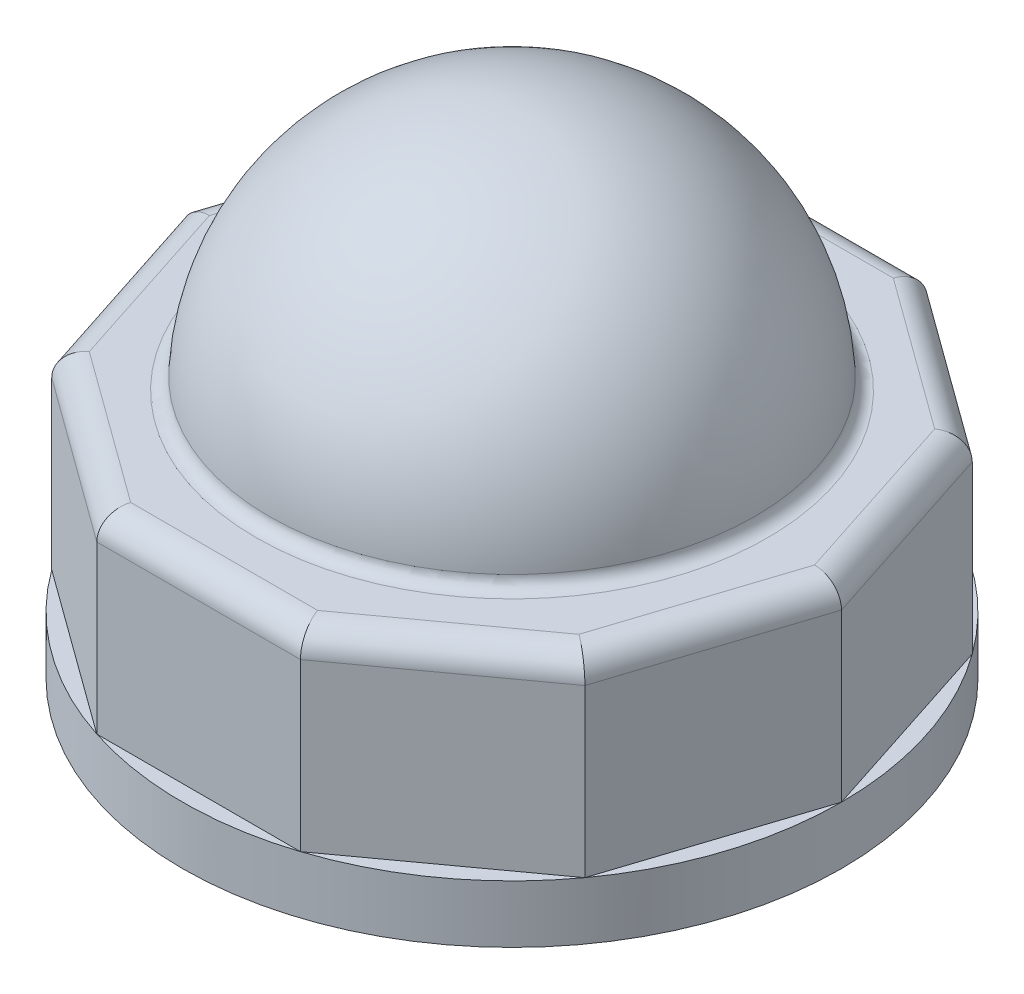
ISO-10303-21;
HEADER;
FILE_DESCRIPTION(('STEP AP214'),'2;1');
FILE_NAME('part.step','',(''),(''),'','','');
FILE_SCHEMA(('AUTOMOTIVE_DESIGN { 1 0 10303 214 1 1 1 1 }'));
ENDSEC;
DATA;
#1=APPLICATION_CONTEXT('core data for automotive mechanical design processes');
#2=APPLICATION_PROTOCOL_DEFINITION('international standard','automotive_design',2000,#1);
#3=PRODUCT_CONTEXT('',#1,'mechanical');
#4=PRODUCT('Part','Part','',(#3));
#5=PRODUCT_RELATED_PRODUCT_CATEGORY('part','',(#4));
#6=PRODUCT_DEFINITION_FORMATION('','',#4);
#7=PRODUCT_DEFINITION_CONTEXT('part definition',#1,'design');
#8=PRODUCT_DEFINITION('design','',#6,#7);
#9=PRODUCT_DEFINITION_SHAPE('','',#8);
#10=(LENGTH_UNIT() NAMED_UNIT(*) SI_UNIT(.MILLI.,.METRE.));
#11=(NAMED_UNIT(*) PLANE_ANGLE_UNIT() SI_UNIT($,.RADIAN.));
#12=(NAMED_UNIT(*) SI_UNIT($,.STERADIAN.) SOLID_ANGLE_UNIT());
#13=UNCERTAINTY_MEASURE_WITH_UNIT(LENGTH_MEASURE(1.E-05),#10,'distance_accuracy_value','');
#14=(GEOMETRIC_REPRESENTATION_CONTEXT(3) GLOBAL_UNCERTAINTY_ASSIGNED_CONTEXT((#13)) GLOBAL_UNIT_ASSIGNED_CONTEXT((#10,
#11,#12)) REPRESENTATION_CONTEXT('',''));
#15=CARTESIAN_POINT('',(0.,0.,0.));
#16=DIRECTION('',(0.,0.,1.));
#17=DIRECTION('',(1.,0.,0.));
#18=AXIS2_PLACEMENT_3D('',#15,#16,#17);
#19=CARTESIAN_POINT('',(0.,0.,0.));
#20=DIRECTION('',(0.,-1.,0.));
#21=DIRECTION('',(0.,0.,-1.));
#22=AXIS2_PLACEMENT_3D('',#19,#20,#21);
#23=CYLINDRICAL_SURFACE('',#22,25.75);
#24=CARTESIAN_POINT('',(0.,0.5,0.));
#25=DIRECTION('',(0.,-1.,0.));
#26=DIRECTION('',(0.,0.,-1.));
#27=AXIS2_PLACEMENT_3D('',#24,#25,#26);
#28=CIRCLE('',#27,25.75);
#29=CARTESIAN_POINT('',(0.,0.5,-25.75));
#30=VERTEX_POINT('',#29);
#31=EDGE_CURVE('E329',#30,#30,#28,.T.);
#32=ORIENTED_EDGE('',*,*,#31,.F.);
#33=EDGE_LOOP('',(#32));
#34=FACE_BOUND('',#33,.T.);
#35=CARTESIAN_POINT('',(0.,5.,0.));
#36=DIRECTION('',(0.,1.,0.));
#37=DIRECTION('',(0.,0.,1.));
#38=AXIS2_PLACEMENT_3D('',#35,#36,#37);
#39=CIRCLE('',#38,25.75);
#40=CARTESIAN_POINT('',(-20.8321876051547,5.,-15.1354702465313));
#41=VERTEX_POINT('',#40);
#42=CARTESIAN_POINT('',(-7.95718760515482,5.,-24.4897052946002));
#43=VERTEX_POINT('',#42);
#44=EDGE_CURVE('E150',#41,#43,#39,.F.);
#45=ORIENTED_EDGE('',*,*,#44,.T.);
#46=CARTESIAN_POINT('',(7.95718760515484,5.,-24.4897052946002));
#47=VERTEX_POINT('',#46);
#48=EDGE_CURVE('E157',#43,#47,#39,.F.);
#49=ORIENTED_EDGE('',*,*,#48,.T.);
#50=CARTESIAN_POINT('',(20.8321876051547,5.,-15.1354702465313));
#51=VERTEX_POINT('',#50);
#52=EDGE_CURVE('E175',#47,#51,#39,.F.);
#53=ORIENTED_EDGE('',*,*,#52,.T.);
#54=CARTESIAN_POINT('',(25.7499999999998,5.,-1.96032508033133E-13));
#55=VERTEX_POINT('',#54);
#56=EDGE_CURVE('E179',#51,#55,#39,.F.);
#57=ORIENTED_EDGE('',*,*,#56,.T.);
#58=CARTESIAN_POINT('',(20.8321876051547,5.,15.1354702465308));
#59=VERTEX_POINT('',#58);
#60=EDGE_CURVE('E790',#55,#59,#39,.F.);
#61=ORIENTED_EDGE('',*,*,#60,.T.);
#62=CARTESIAN_POINT('',(7.95718760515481,5.,24.4897052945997));
#63=VERTEX_POINT('',#62);
#64=EDGE_CURVE('E788',#59,#63,#39,.F.);
#65=ORIENTED_EDGE('',*,*,#64,.T.);
#66=CARTESIAN_POINT('',(-7.95718760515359,5.,24.4897052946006));
#67=VERTEX_POINT('',#66);
#68=EDGE_CURVE('E783',#63,#67,#39,.F.);
#69=ORIENTED_EDGE('',*,*,#68,.T.);
#70=CARTESIAN_POINT('',(-20.8321876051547,5.,15.1354702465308));
#71=VERTEX_POINT('',#70);
#72=EDGE_CURVE('E174',#67,#71,#39,.F.);
#73=ORIENTED_EDGE('',*,*,#72,.T.);
#74=CARTESIAN_POINT('',(-25.7499999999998,5.,-2.65074807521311E-13));
#75=VERTEX_POINT('',#74);
#76=EDGE_CURVE('E173',#71,#75,#39,.F.);
#77=ORIENTED_EDGE('',*,*,#76,.T.);
#78=EDGE_CURVE('E158',#75,#41,#39,.F.);
#79=ORIENTED_EDGE('',*,*,#78,.T.);
#80=EDGE_LOOP('',(#45,#49,#53,#57,#61,#65,#69,#73,#77,#79));
#81=FACE_BOUND('',#80,.T.);
#82=ADVANCED_FACE('F34',(#34,#81),#23,.T.);
#83=CARTESIAN_POINT('',(18.,17.,0.));
#84=DIRECTION('',(0.,-1.,0.));
#85=DIRECTION('',(0.,0.,-1.));
#86=AXIS2_PLACEMENT_3D('',#83,#84,#85);
#87=PLANE('',#86);
#88=CARTESIAN_POINT('',(0.,17.,0.));
#89=DIRECTION('',(0.,-1.,0.));
#90=DIRECTION('',(0.,0.,-1.));
#91=AXIS2_PLACEMENT_3D('',#88,#89,#90);
#92=CIRCLE('',#91,18.);
#93=CARTESIAN_POINT('',(0.,17.,-18.));
#94=VERTEX_POINT('',#93);
#95=EDGE_CURVE('E144',#94,#94,#92,.T.);
#96=ORIENTED_EDGE('',*,*,#95,.T.);
#97=EDGE_LOOP('',(#96));
#98=FACE_BOUND('',#97,.T.);
#99=CARTESIAN_POINT('',(0.,17.,0.));
#100=DIRECTION('',(0.,-1.,0.));
#101=DIRECTION('',(0.,0.,-1.));
#102=AXIS2_PLACEMENT_3D('',#99,#100,#101);
#103=CIRCLE('',#102,16.);
#104=CARTESIAN_POINT('',(0.,17.,-16.));
#105=VERTEX_POINT('',#104);
#106=EDGE_CURVE('E180',#105,#105,#103,.T.);
#107=ORIENTED_EDGE('',*,*,#106,.F.);
#108=EDGE_LOOP('',(#107));
#109=FACE_BOUND('',#108,.T.);
#110=ADVANCED_FACE('F36',(#98,#109),#87,.T.);
#111=CARTESIAN_POINT('',(0.,0.,0.));
#112=DIRECTION('',(0.,-1.,0.));
#113=DIRECTION('',(0.,0.,-1.));
#114=AXIS2_PLACEMENT_3D('',#111,#112,#113);
#115=CYLINDRICAL_SURFACE('',#114,16.);
#116=ORIENTED_EDGE('',*,*,#106,.T.);
#117=EDGE_LOOP('',(#116));
#118=FACE_BOUND('',#117,.T.);
#119=CARTESIAN_POINT('',(0.,20.,0.));
#120=DIRECTION('',(0.,-1.,0.));
#121=DIRECTION('',(0.,0.,-1.));
#122=AXIS2_PLACEMENT_3D('',#119,#120,#121);
#123=CIRCLE('',#122,16.);
#124=CARTESIAN_POINT('',(0.,20.,-16.));
#125=VERTEX_POINT('',#124);
#126=EDGE_CURVE('E331',#125,#125,#123,.T.);
#127=ORIENTED_EDGE('',*,*,#126,.F.);
#128=EDGE_LOOP('',(#127));
#129=FACE_BOUND('',#128,.T.);
#130=ADVANCED_FACE('F338',(#118,#129),#115,.F.);
#131=CARTESIAN_POINT('',(0.,20.,0.));
#132=DIRECTION('',(0.,-1.,0.));
#133=DIRECTION('',(-1.,0.,0.));
#134=AXIS2_PLACEMENT_3D('',#131,#132,#133);
#135=SPHERICAL_SURFACE('',#134,16.);
#136=ORIENTED_EDGE('',*,*,#126,.T.);
#137=EDGE_LOOP('',(#136));
#138=FACE_BOUND('',#137,.T.);
#139=ADVANCED_FACE('F347',(#138),#135,.F.);
#140=CARTESIAN_POINT('',(25.75,0.5,0.));
#141=DIRECTION('',(0.,-1.,0.));
#142=DIRECTION('',(0.,0.,-1.));
#143=AXIS2_PLACEMENT_3D('',#140,#141,#142);
#144=PLANE('',#143);
#145=ORIENTED_EDGE('',*,*,#31,.T.);
#146=EDGE_LOOP('',(#145));
#147=FACE_BOUND('',#146,.T.);
#148=CARTESIAN_POINT('',(0.,0.5,0.));
#149=DIRECTION('',(0.,-1.,0.));
#150=DIRECTION('',(0.,0.,-1.));
#151=AXIS2_PLACEMENT_3D('',#148,#149,#150);
#152=CIRCLE('',#151,24.);
#153=CARTESIAN_POINT('',(0.,0.5,-24.));
#154=VERTEX_POINT('',#153);
#155=EDGE_CURVE('E326',#154,#154,#152,.T.);
#156=ORIENTED_EDGE('',*,*,#155,.F.);
#157=EDGE_LOOP('',(#156));
#158=FACE_BOUND('',#157,.T.);
#159=ADVANCED_FACE('F397',(#147,#158),#144,.T.);
#160=CARTESIAN_POINT('',(0.,0.,0.));
#161=DIRECTION('',(0.,-1.,0.));
#162=DIRECTION('',(0.,0.,-1.));
#163=AXIS2_PLACEMENT_3D('',#160,#161,#162);
#164=CYLINDRICAL_SURFACE('',#163,24.);
#165=ORIENTED_EDGE('',*,*,#155,.T.);
#166=EDGE_LOOP('',(#165));
#167=FACE_BOUND('',#166,.T.);
#168=CARTESIAN_POINT('',(0.,0.,0.));
#169=DIRECTION('',(0.,-1.,0.));
#170=DIRECTION('',(0.,0.,-1.));
#171=AXIS2_PLACEMENT_3D('',#168,#169,#170);
#172=CIRCLE('',#171,24.);
#173=CARTESIAN_POINT('',(0.,0.,-24.));
#174=VERTEX_POINT('',#173);
#175=EDGE_CURVE('E323',#174,#174,#172,.T.);
#176=ORIENTED_EDGE('',*,*,#175,.F.);
#177=EDGE_LOOP('',(#176));
#178=FACE_BOUND('',#177,.T.);
#179=ADVANCED_FACE('F393',(#167,#178),#164,.T.);
#180=CARTESIAN_POINT('',(24.,0.,0.));
#181=DIRECTION('',(0.,-1.,0.));
#182=DIRECTION('',(0.,0.,-1.));
#183=AXIS2_PLACEMENT_3D('',#180,#181,#182);
#184=PLANE('',#183);
#185=ORIENTED_EDGE('',*,*,#175,.T.);
#186=EDGE_LOOP('',(#185));
#187=FACE_BOUND('',#186,.T.);
#188=CARTESIAN_POINT('',(0.,0.,0.));
#189=DIRECTION('',(0.,-1.,0.));
#190=DIRECTION('',(0.,0.,-1.));
#191=AXIS2_PLACEMENT_3D('',#188,#189,#190);
#192=CIRCLE('',#191,23.5);
#193=CARTESIAN_POINT('',(0.,0.,-23.5));
#194=VERTEX_POINT('',#193);
#195=EDGE_CURVE('E320',#194,#194,#192,.T.);
#196=ORIENTED_EDGE('',*,*,#195,.F.);
#197=EDGE_LOOP('',(#196));
#198=FACE_BOUND('',#197,.T.);
#199=ADVANCED_FACE('F389',(#187,#198),#184,.T.);
#200=CARTESIAN_POINT('',(0.,0.,0.));
#201=DIRECTION('',(0.,-1.,0.));
#202=DIRECTION('',(0.,0.,-1.));
#203=AXIS2_PLACEMENT_3D('',#200,#201,#202);
#204=CYLINDRICAL_SURFACE('',#203,23.5);
#205=ORIENTED_EDGE('',*,*,#195,.T.);
#206=EDGE_LOOP('',(#205));
#207=FACE_BOUND('',#206,.T.);
#208=CARTESIAN_POINT('',(0.,1.,0.));
#209=DIRECTION('',(0.,-1.,0.));
#210=DIRECTION('',(0.,0.,-1.));
#211=AXIS2_PLACEMENT_3D('',#208,#209,#210);
#212=CIRCLE('',#211,23.5);
#213=CARTESIAN_POINT('',(0.,1.,-23.5));
#214=VERTEX_POINT('',#213);
#215=EDGE_CURVE('E317',#214,#214,#212,.T.);
#216=ORIENTED_EDGE('',*,*,#215,.F.);
#217=EDGE_LOOP('',(#216));
#218=FACE_BOUND('',#217,.T.);
#219=ADVANCED_FACE('F385',(#207,#218),#204,.F.);
#220=CARTESIAN_POINT('',(23.5,1.,0.));
#221=DIRECTION('',(0.,-1.,0.));
#222=DIRECTION('',(0.,0.,-1.));
#223=AXIS2_PLACEMENT_3D('',#220,#221,#222);
#224=PLANE('',#223);
#225=ORIENTED_EDGE('',*,*,#215,.T.);
#226=EDGE_LOOP('',(#225));
#227=FACE_BOUND('',#226,.T.);
#228=CARTESIAN_POINT('',(0.,1.,0.));
#229=DIRECTION('',(0.,-1.,0.));
#230=DIRECTION('',(0.,0.,-1.));
#231=AXIS2_PLACEMENT_3D('',#228,#229,#230);
#232=CIRCLE('',#231,23.);
#233=CARTESIAN_POINT('',(0.,1.,-23.));
#234=VERTEX_POINT('',#233);
#235=EDGE_CURVE('E314',#234,#234,#232,.T.);
#236=ORIENTED_EDGE('',*,*,#235,.F.);
#237=EDGE_LOOP('',(#236));
#238=FACE_BOUND('',#237,.T.);
#239=ADVANCED_FACE('F381',(#227,#238),#224,.T.);
#240=CARTESIAN_POINT('',(0.,0.,0.));
#241=DIRECTION('',(0.,-1.,0.));
#242=DIRECTION('',(0.,0.,-1.));
#243=AXIS2_PLACEMENT_3D('',#240,#241,#242);
#244=CYLINDRICAL_SURFACE('',#243,23.);
#245=ORIENTED_EDGE('',*,*,#235,.T.);
#246=EDGE_LOOP('',(#245));
#247=FACE_BOUND('',#246,.T.);
#248=CARTESIAN_POINT('',(0.,3.,0.));
#249=DIRECTION('',(0.,-1.,0.));
#250=DIRECTION('',(0.,0.,-1.));
#251=AXIS2_PLACEMENT_3D('',#248,#249,#250);
#252=CIRCLE('',#251,23.);
#253=CARTESIAN_POINT('',(0.,3.,-23.));
#254=VERTEX_POINT('',#253);
#255=EDGE_CURVE('E311',#254,#254,#252,.T.);
#256=ORIENTED_EDGE('',*,*,#255,.F.);
#257=EDGE_LOOP('',(#256));
#258=FACE_BOUND('',#257,.T.);
#259=ADVANCED_FACE('F377',(#247,#258),#244,.F.);
#260=CARTESIAN_POINT('',(23.,3.,0.));
#261=DIRECTION('',(0.,-1.,0.));
#262=DIRECTION('',(0.,0.,-1.));
#263=AXIS2_PLACEMENT_3D('',#260,#261,#262);
#264=PLANE('',#263);
#265=ORIENTED_EDGE('',*,*,#255,.T.);
#266=EDGE_LOOP('',(#265));
#267=FACE_BOUND('',#266,.T.);
#268=CARTESIAN_POINT('',(0.,3.,0.));
#269=DIRECTION('',(0.,-1.,0.));
#270=DIRECTION('',(0.,0.,-1.));
#271=AXIS2_PLACEMENT_3D('',#268,#269,#270);
#272=CIRCLE('',#271,21.);
#273=CARTESIAN_POINT('',(0.,3.,-21.));
#274=VERTEX_POINT('',#273);
#275=EDGE_CURVE('E308',#274,#274,#272,.T.);
#276=ORIENTED_EDGE('',*,*,#275,.F.);
#277=EDGE_LOOP('',(#276));
#278=FACE_BOUND('',#277,.T.);
#279=ADVANCED_FACE('F373',(#267,#278),#264,.T.);
#280=CARTESIAN_POINT('',(0.,0.,0.));
#281=DIRECTION('',(0.,-1.,0.));
#282=DIRECTION('',(0.,0.,-1.));
#283=AXIS2_PLACEMENT_3D('',#280,#281,#282);
#284=CYLINDRICAL_SURFACE('',#283,21.);
#285=ORIENTED_EDGE('',*,*,#275,.T.);
#286=EDGE_LOOP('',(#285));
#287=FACE_BOUND('',#286,.T.);
#288=CARTESIAN_POINT('',(0.,16.,0.));
#289=DIRECTION('',(0.,-1.,0.));
#290=DIRECTION('',(0.,0.,-1.));
#291=AXIS2_PLACEMENT_3D('',#288,#289,#290);
#292=CIRCLE('',#291,21.);
#293=CARTESIAN_POINT('',(0.,16.,-21.));
#294=VERTEX_POINT('',#293);
#295=EDGE_CURVE('E305',#294,#294,#292,.T.);
#296=ORIENTED_EDGE('',*,*,#295,.F.);
#297=EDGE_LOOP('',(#296));
#298=FACE_BOUND('',#297,.T.);
#299=ADVANCED_FACE('F366',(#287,#298),#284,.F.);
#300=CARTESIAN_POINT('',(21.,16.,0.));
#301=DIRECTION('',(0.,-1.,0.));
#302=DIRECTION('',(0.,0.,-1.));
#303=AXIS2_PLACEMENT_3D('',#300,#301,#302);
#304=PLANE('',#303);
#305=ORIENTED_EDGE('',*,*,#295,.T.);
#306=EDGE_LOOP('',(#305));
#307=FACE_BOUND('',#306,.T.);
#308=CARTESIAN_POINT('',(0.,16.,0.));
#309=DIRECTION('',(0.,-1.,0.));
#310=DIRECTION('',(0.,0.,-1.));
#311=AXIS2_PLACEMENT_3D('',#308,#309,#310);
#312=CIRCLE('',#311,18.);
#313=CARTESIAN_POINT('',(0.,16.,-18.));
#314=VERTEX_POINT('',#313);
#315=EDGE_CURVE('E302',#314,#314,#312,.T.);
#316=ORIENTED_EDGE('',*,*,#315,.F.);
#317=EDGE_LOOP('',(#316));
#318=FACE_BOUND('',#317,.T.);
#319=ADVANCED_FACE('F355',(#307,#318),#304,.T.);
#320=CARTESIAN_POINT('',(0.,0.,0.));
#321=DIRECTION('',(0.,-1.,0.));
#322=DIRECTION('',(0.,0.,-1.));
#323=AXIS2_PLACEMENT_3D('',#320,#321,#322);
#324=CYLINDRICAL_SURFACE('',#323,18.);
#325=ORIENTED_EDGE('',*,*,#315,.T.);
#326=EDGE_LOOP('',(#325));
#327=FACE_BOUND('',#326,.T.);
#328=ORIENTED_EDGE('',*,*,#95,.F.);
#329=EDGE_LOOP('',(#328));
#330=FACE_BOUND('',#329,.T.);
#331=ADVANCED_FACE('F352',(#327,#330),#324,.F.);
#332=CARTESIAN_POINT('',(0.,5.,0.));
#333=DIRECTION('',(0.,1.,0.));
#334=DIRECTION('',(0.,0.,1.));
#335=AXIS2_PLACEMENT_3D('',#332,#333,#334);
#336=PLANE('',#335);
#337=DIRECTION('',(0.809016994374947,0.,0.587785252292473));
#338=VECTOR('',#337,1.);
#339=CARTESIAN_POINT('',(-7.95718760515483,5.,24.4897052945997));
#340=LINE('',#339,#338);
#341=EDGE_CURVE('E269',#71,#67,#340,.T.);
#342=ORIENTED_EDGE('',*,*,#341,.F.);
#343=ORIENTED_EDGE('',*,*,#72,.F.);
#344=EDGE_LOOP('',(#342,#343));
#345=FACE_BOUND('',#344,.T.);
#346=ADVANCED_FACE('F354',(#345),#336,.T.);
#347=DIRECTION('',(0.309016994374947,0.,0.951056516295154));
#348=VECTOR('',#347,1.);
#349=CARTESIAN_POINT('',(-20.8321876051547,5.,15.1354702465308));
#350=LINE('',#349,#348);
#351=EDGE_CURVE('E164',#75,#71,#350,.T.);
#352=ORIENTED_EDGE('',*,*,#351,.F.);
#353=ORIENTED_EDGE('',*,*,#76,.F.);
#354=EDGE_LOOP('',(#352,#353));
#355=FACE_BOUND('',#354,.T.);
#356=ADVANCED_FACE('F362',(#355),#336,.T.);
#357=DIRECTION('',(-0.309016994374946,0.,0.951056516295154));
#358=VECTOR('',#357,1.);
#359=CARTESIAN_POINT('',(-25.7499999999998,5.,-2.65074807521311E-13));
#360=LINE('',#359,#358);
#361=EDGE_CURVE('E141',#41,#75,#360,.T.);
#362=ORIENTED_EDGE('',*,*,#361,.F.);
#363=ORIENTED_EDGE('',*,*,#78,.F.);
#364=EDGE_LOOP('',(#362,#363));
#365=FACE_BOUND('',#364,.T.);
#366=ADVANCED_FACE('F162',(#365),#336,.T.);
#367=DIRECTION('',(-0.809016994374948,0.,0.587785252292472));
#368=VECTOR('',#367,1.);
#369=CARTESIAN_POINT('',(-20.8321876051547,5.,-15.1354702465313));
#370=LINE('',#369,#368);
#371=EDGE_CURVE('E152',#43,#41,#370,.T.);
#372=ORIENTED_EDGE('',*,*,#371,.F.);
#373=ORIENTED_EDGE('',*,*,#44,.F.);
#374=EDGE_LOOP('',(#372,#373));
#375=FACE_BOUND('',#374,.T.);
#376=ADVANCED_FACE('F151',(#375),#336,.T.);
#377=DIRECTION('',(-1.,0.,0.));
#378=VECTOR('',#377,1.);
#379=CARTESIAN_POINT('',(-7.95718760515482,5.,-24.4897052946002));
#380=LINE('',#379,#378);
#381=EDGE_CURVE('E285',#47,#43,#380,.T.);
#382=ORIENTED_EDGE('',*,*,#381,.F.);
#383=ORIENTED_EDGE('',*,*,#48,.F.);
#384=EDGE_LOOP('',(#382,#383));
#385=FACE_BOUND('',#384,.T.);
#386=ADVANCED_FACE('F492',(#385),#336,.T.);
#387=DIRECTION('',(-0.809016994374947,0.,-0.587785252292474));
#388=VECTOR('',#387,1.);
#389=CARTESIAN_POINT('',(7.95718760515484,5.,-24.4897052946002));
#390=LINE('',#389,#388);
#391=EDGE_CURVE('E241',#51,#47,#390,.T.);
#392=ORIENTED_EDGE('',*,*,#391,.F.);
#393=ORIENTED_EDGE('',*,*,#52,.F.);
#394=EDGE_LOOP('',(#392,#393));
#395=FACE_BOUND('',#394,.T.);
#396=ADVANCED_FACE('F500',(#395),#336,.T.);
#397=DIRECTION('',(-0.309016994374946,0.,-0.951056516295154));
#398=VECTOR('',#397,1.);
#399=CARTESIAN_POINT('',(20.8321876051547,5.,-15.1354702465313));
#400=LINE('',#399,#398);
#401=EDGE_CURVE('E281',#55,#51,#400,.T.);
#402=ORIENTED_EDGE('',*,*,#401,.F.);
#403=ORIENTED_EDGE('',*,*,#56,.F.);
#404=EDGE_LOOP('',(#402,#403));
#405=FACE_BOUND('',#404,.T.);
#406=ADVANCED_FACE('F509',(#405),#336,.T.);
#407=DIRECTION('',(0.309016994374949,0.,-0.951056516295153));
#408=VECTOR('',#407,1.);
#409=CARTESIAN_POINT('',(25.7499999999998,5.,-1.96032508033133E-13));
#410=LINE('',#409,#408);
#411=EDGE_CURVE('E278',#59,#55,#410,.T.);
#412=ORIENTED_EDGE('',*,*,#411,.F.);
#413=ORIENTED_EDGE('',*,*,#60,.F.);
#414=EDGE_LOOP('',(#412,#413));
#415=FACE_BOUND('',#414,.T.);
#416=ADVANCED_FACE('F518',(#415),#336,.T.);
#417=DIRECTION('',(0.809016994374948,0.,-0.587785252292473));
#418=VECTOR('',#417,1.);
#419=CARTESIAN_POINT('',(20.8321876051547,5.,15.1354702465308));
#420=LINE('',#419,#418);
#421=EDGE_CURVE('E275',#63,#59,#420,.T.);
#422=ORIENTED_EDGE('',*,*,#421,.F.);
#423=ORIENTED_EDGE('',*,*,#64,.F.);
#424=EDGE_LOOP('',(#422,#423));
#425=FACE_BOUND('',#424,.T.);
#426=ADVANCED_FACE('F527',(#425),#336,.T.);
#427=DIRECTION('',(1.,0.,0.));
#428=VECTOR('',#427,1.);
#429=CARTESIAN_POINT('',(7.95718760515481,5.,24.4897052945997));
#430=LINE('',#429,#428);
#431=EDGE_CURVE('E272',#67,#63,#430,.T.);
#432=ORIENTED_EDGE('',*,*,#431,.F.);
#433=ORIENTED_EDGE('',*,*,#68,.F.);
#434=EDGE_LOOP('',(#432,#433));
#435=FACE_BOUND('',#434,.T.);
#436=ADVANCED_FACE('F365',(#435),#336,.T.);
#437=CARTESIAN_POINT('',(-20.8321876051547,25.,-15.1354702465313));
#438=DIRECTION('',(0.587785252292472,0.,0.809016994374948));
#439=DIRECTION('',(0.809016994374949,0.,-0.587785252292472));
#440=AXIS2_PLACEMENT_3D('',#437,#438,#439);
#441=PLANE('',#440);
#442=DIRECTION('',(0.,-1.,0.));
#443=VECTOR('',#442,1.);
#444=CARTESIAN_POINT('',(-20.8321876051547,25.,-15.1354702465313));
#445=LINE('',#444,#443);
#446=CARTESIAN_POINT('',(-20.8321876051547,18.,-15.1354702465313));
#447=VERTEX_POINT('',#446);
#448=EDGE_CURVE('E137',#447,#41,#445,.T.);
#449=ORIENTED_EDGE('',*,*,#448,.F.);
#450=DIRECTION('',(0.809016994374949,0.,-0.587785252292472));
#451=VECTOR('',#450,1.);
#452=CARTESIAN_POINT('',(-7.9571876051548,18.,-24.4897052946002));
#453=LINE('',#452,#451);
#454=CARTESIAN_POINT('',(-7.95718760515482,18.,-24.4897052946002));
#455=VERTEX_POINT('',#454);
#456=EDGE_CURVE('E42',#447,#455,#453,.T.);
#457=ORIENTED_EDGE('',*,*,#456,.T.);
#458=DIRECTION('',(0.,-1.,0.));
#459=VECTOR('',#458,1.);
#460=CARTESIAN_POINT('',(-7.95718760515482,25.,-24.4897052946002));
#461=LINE('',#460,#459);
#462=EDGE_CURVE('E167',#455,#43,#461,.T.);
#463=ORIENTED_EDGE('',*,*,#462,.T.);
#464=ORIENTED_EDGE('',*,*,#371,.T.);
#465=EDGE_LOOP('',(#449,#457,#463,#464));
#466=FACE_BOUND('',#465,.T.);
#467=ADVANCED_FACE('F166',(#466),#441,.F.);
#468=CARTESIAN_POINT('',(-25.7499999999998,25.,-2.65074807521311E-13));
#469=DIRECTION('',(0.951056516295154,0.,0.309016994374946));
#470=DIRECTION('',(0.309016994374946,0.,-0.951056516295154));
#471=AXIS2_PLACEMENT_3D('',#468,#469,#470);
#472=PLANE('',#471);
#473=DIRECTION('',(0.,-1.,0.));
#474=VECTOR('',#473,1.);
#475=CARTESIAN_POINT('',(-25.7499999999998,25.,-2.65074807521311E-13));
#476=LINE('',#475,#474);
#477=CARTESIAN_POINT('',(-25.7499999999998,18.,-2.65074807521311E-13));
#478=VERTEX_POINT('',#477);
#479=EDGE_CURVE('E145',#478,#75,#476,.T.);
#480=ORIENTED_EDGE('',*,*,#479,.F.);
#481=DIRECTION('',(0.309016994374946,0.,-0.951056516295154));
#482=VECTOR('',#481,1.);
#483=CARTESIAN_POINT('',(-20.8321876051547,18.,-15.1354702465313));
#484=LINE('',#483,#482);
#485=EDGE_CURVE('E12',#478,#447,#484,.T.);
#486=ORIENTED_EDGE('',*,*,#485,.T.);
#487=ORIENTED_EDGE('',*,*,#448,.T.);
#488=ORIENTED_EDGE('',*,*,#361,.T.);
#489=EDGE_LOOP('',(#480,#486,#487,#488));
#490=FACE_BOUND('',#489,.T.);
#491=ADVANCED_FACE('F139',(#490),#472,.F.);
#492=CARTESIAN_POINT('',(-20.8321876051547,25.,15.1354702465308));
#493=DIRECTION('',(0.951056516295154,0.,-0.309016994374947));
#494=DIRECTION('',(-0.309016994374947,0.,-0.951056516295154));
#495=AXIS2_PLACEMENT_3D('',#492,#493,#494);
#496=PLANE('',#495);
#497=DIRECTION('',(0.,-1.,0.));
#498=VECTOR('',#497,1.);
#499=CARTESIAN_POINT('',(-20.8321876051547,25.,15.1354702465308));
#500=LINE('',#499,#498);
#501=CARTESIAN_POINT('',(-20.8321876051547,18.,15.1354702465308));
#502=VERTEX_POINT('',#501);
#503=EDGE_CURVE('E297',#502,#71,#500,.T.);
#504=ORIENTED_EDGE('',*,*,#503,.F.);
#505=DIRECTION('',(-0.309016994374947,0.,-0.951056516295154));
#506=VECTOR('',#505,1.);
#507=CARTESIAN_POINT('',(-25.7499999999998,18.,-2.6980673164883E-13));
#508=LINE('',#507,#506);
#509=EDGE_CURVE('E188',#502,#478,#508,.T.);
#510=ORIENTED_EDGE('',*,*,#509,.T.);
#511=ORIENTED_EDGE('',*,*,#479,.T.);
#512=ORIENTED_EDGE('',*,*,#351,.T.);
#513=EDGE_LOOP('',(#504,#510,#511,#512));
#514=FACE_BOUND('',#513,.T.);
#515=ADVANCED_FACE('F580',(#514),#496,.F.);
#516=CARTESIAN_POINT('',(-7.95718760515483,25.,24.4897052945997));
#517=DIRECTION('',(0.587785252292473,0.,-0.809016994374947));
#518=DIRECTION('',(-0.809016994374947,0.,-0.587785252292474));
#519=AXIS2_PLACEMENT_3D('',#516,#517,#518);
#520=PLANE('',#519);
#521=DIRECTION('',(0.,-1.,0.));
#522=VECTOR('',#521,1.);
#523=CARTESIAN_POINT('',(-7.95718760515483,25.,24.4897052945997));
#524=LINE('',#523,#522);
#525=CARTESIAN_POINT('',(-7.95718760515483,18.,24.4897052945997));
#526=VERTEX_POINT('',#525);
#527=EDGE_CURVE('E295',#526,#67,#524,.T.);
#528=ORIENTED_EDGE('',*,*,#527,.F.);
#529=DIRECTION('',(-0.809016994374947,0.,-0.587785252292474));
#530=VECTOR('',#529,1.);
#531=CARTESIAN_POINT('',(-20.8321876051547,18.,15.1354702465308));
#532=LINE('',#531,#530);
#533=EDGE_CURVE('E212',#526,#502,#532,.T.);
#534=ORIENTED_EDGE('',*,*,#533,.T.);
#535=ORIENTED_EDGE('',*,*,#503,.T.);
#536=ORIENTED_EDGE('',*,*,#341,.T.);
#537=EDGE_LOOP('',(#528,#534,#535,#536));
#538=FACE_BOUND('',#537,.T.);
#539=ADVANCED_FACE('F589',(#538),#520,.F.);
#540=CARTESIAN_POINT('',(7.95718760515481,25.,24.4897052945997));
#541=DIRECTION('',(0.,0.,-1.));
#542=DIRECTION('',(-1.,0.,0.));
#543=AXIS2_PLACEMENT_3D('',#540,#541,#542);
#544=PLANE('',#543);
#545=DIRECTION('',(0.,-1.,0.));
#546=VECTOR('',#545,1.);
#547=CARTESIAN_POINT('',(7.95718760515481,25.,24.4897052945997));
#548=LINE('',#547,#546);
#549=CARTESIAN_POINT('',(7.95718760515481,18.,24.4897052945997));
#550=VERTEX_POINT('',#549);
#551=EDGE_CURVE('E293',#550,#63,#548,.T.);
#552=ORIENTED_EDGE('',*,*,#551,.F.);
#553=DIRECTION('',(-1.,0.,0.));
#554=VECTOR('',#553,1.);
#555=CARTESIAN_POINT('',(-7.95718760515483,18.,24.4897052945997));
#556=LINE('',#555,#554);
#557=EDGE_CURVE('E214',#550,#526,#556,.T.);
#558=ORIENTED_EDGE('',*,*,#557,.T.);
#559=ORIENTED_EDGE('',*,*,#527,.T.);
#560=ORIENTED_EDGE('',*,*,#431,.T.);
#561=EDGE_LOOP('',(#552,#558,#559,#560));
#562=FACE_BOUND('',#561,.T.);
#563=ADVANCED_FACE('F599',(#562),#544,.F.);
#564=CARTESIAN_POINT('',(20.8321876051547,25.,15.1354702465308));
#565=DIRECTION('',(-0.587785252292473,0.,-0.809016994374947));
#566=DIRECTION('',(-0.809016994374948,0.,0.587785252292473));
#567=AXIS2_PLACEMENT_3D('',#564,#565,#566);
#568=PLANE('',#567);
#569=DIRECTION('',(0.,-1.,0.));
#570=VECTOR('',#569,1.);
#571=CARTESIAN_POINT('',(20.8321876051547,25.,15.1354702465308));
#572=LINE('',#571,#570);
#573=CARTESIAN_POINT('',(20.8321876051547,18.,15.1354702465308));
#574=VERTEX_POINT('',#573);
#575=EDGE_CURVE('E291',#574,#59,#572,.T.);
#576=ORIENTED_EDGE('',*,*,#575,.F.);
#577=DIRECTION('',(-0.809016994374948,0.,0.587785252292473));
#578=VECTOR('',#577,1.);
#579=CARTESIAN_POINT('',(7.95718760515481,18.,24.4897052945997));
#580=LINE('',#579,#578);
#581=EDGE_CURVE('E216',#574,#550,#580,.T.);
#582=ORIENTED_EDGE('',*,*,#581,.T.);
#583=ORIENTED_EDGE('',*,*,#551,.T.);
#584=ORIENTED_EDGE('',*,*,#421,.T.);
#585=EDGE_LOOP('',(#576,#582,#583,#584));
#586=FACE_BOUND('',#585,.T.);
#587=ADVANCED_FACE('F609',(#586),#568,.F.);
#588=CARTESIAN_POINT('',(25.7499999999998,25.,-1.96032508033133E-13));
#589=DIRECTION('',(-0.951056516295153,0.,-0.309016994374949));
#590=DIRECTION('',(-0.309016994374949,0.,0.951056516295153));
#591=AXIS2_PLACEMENT_3D('',#588,#589,#590);
#592=PLANE('',#591);
#593=DIRECTION('',(0.,-1.,0.));
#594=VECTOR('',#593,1.);
#595=CARTESIAN_POINT('',(25.7499999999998,25.,-1.96032508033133E-13));
#596=LINE('',#595,#594);
#597=CARTESIAN_POINT('',(25.7499999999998,18.,-1.96032508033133E-13));
#598=VERTEX_POINT('',#597);
#599=EDGE_CURVE('E289',#598,#55,#596,.T.);
#600=ORIENTED_EDGE('',*,*,#599,.F.);
#601=DIRECTION('',(-0.309016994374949,0.,0.951056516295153));
#602=VECTOR('',#601,1.);
#603=CARTESIAN_POINT('',(20.8321876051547,18.,15.1354702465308));
#604=LINE('',#603,#602);
#605=EDGE_CURVE('E218',#598,#574,#604,.T.);
#606=ORIENTED_EDGE('',*,*,#605,.T.);
#607=ORIENTED_EDGE('',*,*,#575,.T.);
#608=ORIENTED_EDGE('',*,*,#411,.T.);
#609=EDGE_LOOP('',(#600,#606,#607,#608));
#610=FACE_BOUND('',#609,.T.);
#611=ADVANCED_FACE('F619',(#610),#592,.F.);
#612=CARTESIAN_POINT('',(20.8321876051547,25.,-15.1354702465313));
#613=DIRECTION('',(-0.951056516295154,0.,0.309016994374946));
#614=DIRECTION('',(0.309016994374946,0.,0.951056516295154));
#615=AXIS2_PLACEMENT_3D('',#612,#613,#614);
#616=PLANE('',#615);
#617=DIRECTION('',(0.,-1.,0.));
#618=VECTOR('',#617,1.);
#619=CARTESIAN_POINT('',(20.8321876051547,25.,-15.1354702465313));
#620=LINE('',#619,#618);
#621=CARTESIAN_POINT('',(20.8321876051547,18.,-15.1354702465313));
#622=VERTEX_POINT('',#621);
#623=EDGE_CURVE('E242',#622,#51,#620,.T.);
#624=ORIENTED_EDGE('',*,*,#623,.F.);
#625=DIRECTION('',(0.309016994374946,0.,0.951056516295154));
#626=VECTOR('',#625,1.);
#627=CARTESIAN_POINT('',(25.7499999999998,18.,-1.93632465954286E-13));
#628=LINE('',#627,#626);
#629=EDGE_CURVE('E220',#622,#598,#628,.T.);
#630=ORIENTED_EDGE('',*,*,#629,.T.);
#631=ORIENTED_EDGE('',*,*,#599,.T.);
#632=ORIENTED_EDGE('',*,*,#401,.T.);
#633=EDGE_LOOP('',(#624,#630,#631,#632));
#634=FACE_BOUND('',#633,.T.);
#635=ADVANCED_FACE('F629',(#634),#616,.F.);
#636=CARTESIAN_POINT('',(7.95718760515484,25.,-24.4897052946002));
#637=DIRECTION('',(-0.587785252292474,0.,0.809016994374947));
#638=DIRECTION('',(0.809016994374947,0.,0.587785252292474));
#639=AXIS2_PLACEMENT_3D('',#636,#637,#638);
#640=PLANE('',#639);
#641=DIRECTION('',(0.,-1.,0.));
#642=VECTOR('',#641,1.);
#643=CARTESIAN_POINT('',(7.95718760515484,25.,-24.4897052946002));
#644=LINE('',#643,#642);
#645=CARTESIAN_POINT('',(7.95718760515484,18.,-24.4897052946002));
#646=VERTEX_POINT('',#645);
#647=EDGE_CURVE('E229',#646,#47,#644,.T.);
#648=ORIENTED_EDGE('',*,*,#647,.F.);
#649=DIRECTION('',(0.809016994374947,0.,0.587785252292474));
#650=VECTOR('',#649,1.);
#651=CARTESIAN_POINT('',(20.8321876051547,18.,-15.1354702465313));
#652=LINE('',#651,#650);
#653=EDGE_CURVE('E222',#646,#622,#652,.T.);
#654=ORIENTED_EDGE('',*,*,#653,.T.);
#655=ORIENTED_EDGE('',*,*,#623,.T.);
#656=ORIENTED_EDGE('',*,*,#391,.T.);
#657=EDGE_LOOP('',(#648,#654,#655,#656));
#658=FACE_BOUND('',#657,.T.);
#659=ADVANCED_FACE('F238',(#658),#640,.F.);
#660=CARTESIAN_POINT('',(-7.95718760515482,25.,-24.4897052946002));
#661=DIRECTION('',(0.,0.,1.));
#662=DIRECTION('',(1.,0.,0.));
#663=AXIS2_PLACEMENT_3D('',#660,#661,#662);
#664=PLANE('',#663);
#665=ORIENTED_EDGE('',*,*,#462,.F.);
#666=DIRECTION('',(1.,0.,0.));
#667=VECTOR('',#666,1.);
#668=CARTESIAN_POINT('',(7.95718760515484,18.,-24.4897052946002));
#669=LINE('',#668,#667);
#670=EDGE_CURVE('E224',#455,#646,#669,.T.);
#671=ORIENTED_EDGE('',*,*,#670,.T.);
#672=ORIENTED_EDGE('',*,*,#647,.T.);
#673=ORIENTED_EDGE('',*,*,#381,.T.);
#674=EDGE_LOOP('',(#665,#671,#672,#673));
#675=FACE_BOUND('',#674,.T.);
#676=ADVANCED_FACE('F228',(#675),#664,.F.);
#677=CARTESIAN_POINT('',(0.,20.,0.));
#678=DIRECTION('',(0.,-1.,0.));
#679=DIRECTION('',(1.,0.,0.));
#680=AXIS2_PLACEMENT_3D('',#677,#678,#679);
#681=SPHERICAL_SURFACE('',#680,19.);
#682=CARTESIAN_POINT('',(0.,20.95,0.));
#683=DIRECTION('',(0.,-1.,0.));
#684=DIRECTION('',(0.,0.,-1.));
#685=AXIS2_PLACEMENT_3D('',#682,#683,#684);
#686=CIRCLE('',#685,18.9762351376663);
#687=CARTESIAN_POINT('',(0.,20.95,-18.9762351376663));
#688=VERTEX_POINT('',#687);
#689=EDGE_CURVE('E185',#688,#688,#686,.F.);
#690=ORIENTED_EDGE('',*,*,#689,.T.);
#691=EDGE_LOOP('',(#690));
#692=FACE_BOUND('',#691,.T.);
#693=ADVANCED_FACE('F406',(#692),#681,.T.);
#694=CARTESIAN_POINT('',(25.75,20.,0.));
#695=DIRECTION('',(0.,1.,0.));
#696=DIRECTION('',(0.,0.,1.));
#697=AXIS2_PLACEMENT_3D('',#694,#695,#696);
#698=PLANE('',#697);
#699=DIRECTION('',(0.309016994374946,0.,-0.951056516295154));
#700=VECTOR('',#699,1.);
#701=CARTESIAN_POINT('',(-23.8478869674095,20.,0.618033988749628));
#702=LINE('',#701,#700);
#703=CARTESIAN_POINT('',(-19.1308859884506,20.,-13.8994022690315));
#704=VERTEX_POINT('',#703);
#705=CARTESIAN_POINT('',(-23.6470755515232,20.,-2.59850979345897E-13));
#706=VERTEX_POINT('',#705);
#707=EDGE_CURVE('E191',#704,#706,#702,.F.);
#708=ORIENTED_EDGE('',*,*,#707,.T.);
#709=DIRECTION('',(-0.309016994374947,0.,-0.951056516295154));
#710=VECTOR('',#709,1.);
#711=CARTESIAN_POINT('',(-18.9300745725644,20.,14.5174362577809));
#712=LINE('',#711,#710);
#713=CARTESIAN_POINT('',(-19.1308859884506,20.,13.899402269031));
#714=VERTEX_POINT('',#713);
#715=EDGE_CURVE('E209',#706,#714,#712,.F.);
#716=ORIENTED_EDGE('',*,*,#715,.T.);
#717=DIRECTION('',(-0.809016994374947,0.,-0.587785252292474));
#718=VECTOR('',#717,1.);
#719=CARTESIAN_POINT('',(-6.78161710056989,20.,22.8716713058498));
#720=LINE('',#719,#718);
#721=CARTESIAN_POINT('',(-7.30734821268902,20.,22.4897052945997));
#722=VERTEX_POINT('',#721);
#723=EDGE_CURVE('E207',#714,#722,#720,.F.);
#724=ORIENTED_EDGE('',*,*,#723,.T.);
#725=DIRECTION('',(-1.,0.,0.));
#726=VECTOR('',#725,1.);
#727=CARTESIAN_POINT('',(7.95718760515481,20.,22.4897052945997));
#728=LINE('',#727,#726);
#729=CARTESIAN_POINT('',(7.307348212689,20.,22.4897052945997));
#730=VERTEX_POINT('',#729);
#731=EDGE_CURVE('E205',#722,#730,#728,.F.);
#732=ORIENTED_EDGE('',*,*,#731,.T.);
#733=DIRECTION('',(-0.809016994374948,0.,0.587785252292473));
#734=VECTOR('',#733,1.);
#735=CARTESIAN_POINT('',(19.6566171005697,20.,13.5174362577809));
#736=LINE('',#735,#734);
#737=CARTESIAN_POINT('',(19.1308859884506,20.,13.899402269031));
#738=VERTEX_POINT('',#737);
#739=EDGE_CURVE('E203',#730,#738,#736,.F.);
#740=ORIENTED_EDGE('',*,*,#739,.T.);
#741=DIRECTION('',(-0.309016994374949,0.,0.951056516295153));
#742=VECTOR('',#741,1.);
#743=CARTESIAN_POINT('',(23.8478869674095,20.,-0.618033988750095));
#744=LINE('',#743,#742);
#745=CARTESIAN_POINT('',(23.6470755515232,20.,-1.987464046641E-13));
#746=VERTEX_POINT('',#745);
#747=EDGE_CURVE('E201',#738,#746,#744,.F.);
#748=ORIENTED_EDGE('',*,*,#747,.T.);
#749=DIRECTION('',(0.309016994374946,0.,0.951056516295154));
#750=VECTOR('',#749,1.);
#751=CARTESIAN_POINT('',(18.9300745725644,20.,-14.5174362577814));
#752=LINE('',#751,#750);
#753=CARTESIAN_POINT('',(19.1308859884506,20.,-13.8994022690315));
#754=VERTEX_POINT('',#753);
#755=EDGE_CURVE('E199',#746,#754,#752,.F.);
#756=ORIENTED_EDGE('',*,*,#755,.T.);
#757=DIRECTION('',(0.809016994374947,0.,0.587785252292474));
#758=VECTOR('',#757,1.);
#759=CARTESIAN_POINT('',(6.78161710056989,20.,-22.8716713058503));
#760=LINE('',#759,#758);
#761=CARTESIAN_POINT('',(7.30734821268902,20.,-22.4897052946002));
#762=VERTEX_POINT('',#761);
#763=EDGE_CURVE('E197',#754,#762,#760,.F.);
#764=ORIENTED_EDGE('',*,*,#763,.T.);
#765=DIRECTION('',(1.,0.,0.));
#766=VECTOR('',#765,1.);
#767=CARTESIAN_POINT('',(-7.95718760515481,20.,-22.4897052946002));
#768=LINE('',#767,#766);
#769=CARTESIAN_POINT('',(-7.307348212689,20.,-22.4897052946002));
#770=VERTEX_POINT('',#769);
#771=EDGE_CURVE('E195',#762,#770,#768,.F.);
#772=ORIENTED_EDGE('',*,*,#771,.T.);
#773=DIRECTION('',(0.809016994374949,0.,-0.587785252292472));
#774=VECTOR('',#773,1.);
#775=CARTESIAN_POINT('',(-19.6566171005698,20.,-13.5174362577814));
#776=LINE('',#775,#774);
#777=EDGE_CURVE('E193',#770,#704,#776,.F.);
#778=ORIENTED_EDGE('',*,*,#777,.T.);
#779=EDGE_LOOP('',(#708,#716,#724,#732,#740,#748,#756,#764,#772,#778));
#780=FACE_BOUND('',#779,.T.);
#781=CARTESIAN_POINT('',(0.,20.,0.));
#782=DIRECTION('',(0.,1.,0.));
#783=DIRECTION('',(0.,0.,1.));
#784=AXIS2_PLACEMENT_3D('',#781,#782,#783);
#785=CIRCLE('',#784,19.9749843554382);
#786=CARTESIAN_POINT('',(0.,20.,19.9749843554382));
#787=VERTEX_POINT('',#786);
#788=EDGE_CURVE('E182',#787,#787,#785,.F.);
#789=ORIENTED_EDGE('',*,*,#788,.T.);
#790=EDGE_LOOP('',(#789));
#791=FACE_BOUND('',#790,.T.);
#792=ADVANCED_FACE('F402',(#780,#791),#698,.T.);
#793=CARTESIAN_POINT('',(0.,21.,0.));
#794=DIRECTION('',(0.,1.,0.));
#795=DIRECTION('',(0.,0.,1.));
#796=AXIS2_PLACEMENT_3D('',#793,#794,#795);
#797=TOROIDAL_SURFACE('',#796,19.9749843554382,1.);
#798=ORIENTED_EDGE('',*,*,#689,.F.);
#799=EDGE_LOOP('',(#798));
#800=FACE_BOUND('',#799,.T.);
#801=ORIENTED_EDGE('',*,*,#788,.F.);
#802=EDGE_LOOP('',(#801));
#803=FACE_BOUND('',#802,.T.);
#804=ADVANCED_FACE('F405',(#800,#803),#797,.F.);
#805=CARTESIAN_POINT('',(18.9300745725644,18.,-14.5174362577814));
#806=DIRECTION('',(-0.309016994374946,0.,-0.951056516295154));
#807=DIRECTION('',(-0.951056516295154,0.,0.309016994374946));
#808=AXIS2_PLACEMENT_3D('',#805,#806,#807);
#809=CYLINDRICAL_SURFACE('',#808,2.);
#810=CARTESIAN_POINT('',(19.1308859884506,18.,-13.8994022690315));
#811=DIRECTION('',(-0.587785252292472,0.,-0.809016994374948));
#812=DIRECTION('',(-0.809016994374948,0.,0.587785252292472));
#813=AXIS2_PLACEMENT_3D('',#810,#811,#812);
#814=ELLIPSE('',#813,2.10292444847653,2.);
#815=EDGE_CURVE('E252',#754,#622,#814,.T.);
#816=ORIENTED_EDGE('',*,*,#815,.F.);
#817=ORIENTED_EDGE('',*,*,#755,.F.);
#818=CARTESIAN_POINT('',(23.6470755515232,18.,-1.99222149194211E-13));
#819=DIRECTION('',(0.,0.,-1.));
#820=DIRECTION('',(-1.,0.,0.));
#821=AXIS2_PLACEMENT_3D('',#818,#819,#820);
#822=ELLIPSE('',#821,2.10292444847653,2.);
#823=EDGE_CURVE('E169',#598,#746,#822,.F.);
#824=ORIENTED_EDGE('',*,*,#823,.F.);
#825=ORIENTED_EDGE('',*,*,#629,.F.);
#826=EDGE_LOOP('',(#816,#817,#824,#825));
#827=FACE_BOUND('',#826,.T.);
#828=ADVANCED_FACE('F562',(#827),#809,.T.);
#829=CARTESIAN_POINT('',(23.8478869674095,18.,-0.618033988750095));
#830=DIRECTION('',(0.309016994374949,0.,-0.951056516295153));
#831=DIRECTION('',(-0.951056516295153,0.,-0.309016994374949));
#832=AXIS2_PLACEMENT_3D('',#829,#830,#831);
#833=CYLINDRICAL_SURFACE('',#832,2.);
#834=ORIENTED_EDGE('',*,*,#823,.T.);
#835=ORIENTED_EDGE('',*,*,#747,.F.);
#836=CARTESIAN_POINT('',(19.1308859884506,18.,13.899402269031));
#837=DIRECTION('',(0.587785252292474,0.,-0.809016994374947));
#838=DIRECTION('',(-0.809016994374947,0.,-0.587785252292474));
#839=AXIS2_PLACEMENT_3D('',#836,#837,#838);
#840=ELLIPSE('',#839,2.10292444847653,2.);
#841=EDGE_CURVE('E254',#574,#738,#840,.F.);
#842=ORIENTED_EDGE('',*,*,#841,.F.);
#843=ORIENTED_EDGE('',*,*,#605,.F.);
#844=EDGE_LOOP('',(#834,#835,#842,#843));
#845=FACE_BOUND('',#844,.T.);
#846=ADVANCED_FACE('F665',(#845),#833,.T.);
#847=CARTESIAN_POINT('',(6.78161710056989,18.,-22.8716713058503));
#848=DIRECTION('',(-0.809016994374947,0.,-0.587785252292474));
#849=DIRECTION('',(-0.587785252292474,0.,0.809016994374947));
#850=AXIS2_PLACEMENT_3D('',#847,#848,#849);
#851=CYLINDRICAL_SURFACE('',#850,2.);
#852=ORIENTED_EDGE('',*,*,#815,.T.);
#853=ORIENTED_EDGE('',*,*,#653,.F.);
#854=CARTESIAN_POINT('',(7.30734821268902,18.,-22.4897052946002));
#855=DIRECTION('',(-0.951056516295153,0.,-0.309016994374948));
#856=DIRECTION('',(-0.309016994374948,0.,0.951056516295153));
#857=AXIS2_PLACEMENT_3D('',#854,#855,#856);
#858=ELLIPSE('',#857,2.10292444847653,2.);
#859=EDGE_CURVE('E249',#762,#646,#858,.T.);
#860=ORIENTED_EDGE('',*,*,#859,.F.);
#861=ORIENTED_EDGE('',*,*,#763,.F.);
#862=EDGE_LOOP('',(#852,#853,#860,#861));
#863=FACE_BOUND('',#862,.T.);
#864=ADVANCED_FACE('F247',(#863),#851,.T.);
#865=CARTESIAN_POINT('',(19.6566171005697,18.,13.5174362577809));
#866=DIRECTION('',(0.809016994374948,0.,-0.587785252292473));
#867=DIRECTION('',(-0.587785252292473,0.,-0.809016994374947));
#868=AXIS2_PLACEMENT_3D('',#865,#866,#867);
#869=CYLINDRICAL_SURFACE('',#868,2.);
#870=ORIENTED_EDGE('',*,*,#841,.T.);
#871=ORIENTED_EDGE('',*,*,#739,.F.);
#872=CARTESIAN_POINT('',(7.307348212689,18.,22.4897052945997));
#873=DIRECTION('',(0.951056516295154,0.,-0.309016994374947));
#874=DIRECTION('',(-0.309016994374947,0.,-0.951056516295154));
#875=AXIS2_PLACEMENT_3D('',#872,#873,#874);
#876=ELLIPSE('',#875,2.10292444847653,2.);
#877=EDGE_CURVE('E255',#550,#730,#876,.F.);
#878=ORIENTED_EDGE('',*,*,#877,.F.);
#879=ORIENTED_EDGE('',*,*,#581,.F.);
#880=EDGE_LOOP('',(#870,#871,#878,#879));
#881=FACE_BOUND('',#880,.T.);
#882=ADVANCED_FACE('F684',(#881),#869,.T.);
#883=CARTESIAN_POINT('',(-7.95718760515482,18.,-22.4897052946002));
#884=DIRECTION('',(-1.,0.,0.));
#885=DIRECTION('',(0.,0.,1.));
#886=AXIS2_PLACEMENT_3D('',#883,#884,#885);
#887=CYLINDRICAL_SURFACE('',#886,2.);
#888=ORIENTED_EDGE('',*,*,#859,.T.);
#889=ORIENTED_EDGE('',*,*,#670,.F.);
#890=CARTESIAN_POINT('',(-7.307348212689,18.,-22.4897052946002));
#891=DIRECTION('',(-0.951056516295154,0.,0.309016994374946));
#892=DIRECTION('',(0.309016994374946,0.,0.951056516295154));
#893=AXIS2_PLACEMENT_3D('',#890,#891,#892);
#894=ELLIPSE('',#893,2.10292444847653,2.);
#895=EDGE_CURVE('E260',#770,#455,#894,.T.);
#896=ORIENTED_EDGE('',*,*,#895,.F.);
#897=ORIENTED_EDGE('',*,*,#771,.F.);
#898=EDGE_LOOP('',(#888,#889,#896,#897));
#899=FACE_BOUND('',#898,.T.);
#900=ADVANCED_FACE('F253',(#899),#887,.T.);
#901=CARTESIAN_POINT('',(7.95718760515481,18.,22.4897052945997));
#902=DIRECTION('',(1.,0.,0.));
#903=DIRECTION('',(0.,0.,-1.));
#904=AXIS2_PLACEMENT_3D('',#901,#902,#903);
#905=CYLINDRICAL_SURFACE('',#904,2.);
#906=ORIENTED_EDGE('',*,*,#877,.T.);
#907=ORIENTED_EDGE('',*,*,#731,.F.);
#908=CARTESIAN_POINT('',(-7.30734821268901,18.,22.4897052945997));
#909=DIRECTION('',(0.951056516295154,0.,0.309016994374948));
#910=DIRECTION('',(0.309016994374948,0.,-0.951056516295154));
#911=AXIS2_PLACEMENT_3D('',#908,#909,#910);
#912=ELLIPSE('',#911,2.10292444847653,2.);
#913=EDGE_CURVE('E767',#526,#722,#912,.F.);
#914=ORIENTED_EDGE('',*,*,#913,.F.);
#915=ORIENTED_EDGE('',*,*,#557,.F.);
#916=EDGE_LOOP('',(#906,#907,#914,#915));
#917=FACE_BOUND('',#916,.T.);
#918=ADVANCED_FACE('F702',(#917),#905,.T.);
#919=CARTESIAN_POINT('',(-19.6566171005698,18.,-13.5174362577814));
#920=DIRECTION('',(-0.809016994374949,0.,0.587785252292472));
#921=DIRECTION('',(0.587785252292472,0.,0.809016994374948));
#922=AXIS2_PLACEMENT_3D('',#919,#920,#921);
#923=CYLINDRICAL_SURFACE('',#922,2.);
#924=ORIENTED_EDGE('',*,*,#895,.T.);
#925=ORIENTED_EDGE('',*,*,#456,.F.);
#926=CARTESIAN_POINT('',(-19.1308859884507,18.,-13.8994022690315));
#927=DIRECTION('',(-0.587785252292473,0.,0.809016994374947));
#928=DIRECTION('',(0.809016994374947,0.,0.587785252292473));
#929=AXIS2_PLACEMENT_3D('',#926,#927,#928);
#930=ELLIPSE('',#929,2.10292444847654,2.);
#931=EDGE_CURVE('E762',#704,#447,#930,.T.);
#932=ORIENTED_EDGE('',*,*,#931,.F.);
#933=ORIENTED_EDGE('',*,*,#777,.F.);
#934=EDGE_LOOP('',(#924,#925,#932,#933));
#935=FACE_BOUND('',#934,.T.);
#936=ADVANCED_FACE('F711',(#935),#923,.T.);
#937=CARTESIAN_POINT('',(-6.78161710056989,18.,22.8716713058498));
#938=DIRECTION('',(0.809016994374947,0.,0.587785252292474));
#939=DIRECTION('',(0.587785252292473,0.,-0.809016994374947));
#940=AXIS2_PLACEMENT_3D('',#937,#938,#939);
#941=CYLINDRICAL_SURFACE('',#940,2.);
#942=ORIENTED_EDGE('',*,*,#913,.T.);
#943=ORIENTED_EDGE('',*,*,#723,.F.);
#944=CARTESIAN_POINT('',(-19.1308859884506,18.,13.899402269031));
#945=DIRECTION('',(0.587785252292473,0.,0.809016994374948));
#946=DIRECTION('',(0.809016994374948,0.,-0.587785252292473));
#947=AXIS2_PLACEMENT_3D('',#944,#945,#946);
#948=ELLIPSE('',#947,2.10292444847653,2.);
#949=EDGE_CURVE('E758',#502,#714,#948,.F.);
#950=ORIENTED_EDGE('',*,*,#949,.F.);
#951=ORIENTED_EDGE('',*,*,#533,.F.);
#952=EDGE_LOOP('',(#942,#943,#950,#951));
#953=FACE_BOUND('',#952,.T.);
#954=ADVANCED_FACE('F721',(#953),#941,.T.);
#955=CARTESIAN_POINT('',(-23.8478869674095,18.,0.618033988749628));
#956=DIRECTION('',(-0.309016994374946,0.,0.951056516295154));
#957=DIRECTION('',(0.951056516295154,0.,0.309016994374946));
#958=AXIS2_PLACEMENT_3D('',#955,#956,#957);
#959=CYLINDRICAL_SURFACE('',#958,2.);
#960=ORIENTED_EDGE('',*,*,#931,.T.);
#961=ORIENTED_EDGE('',*,*,#485,.F.);
#962=CARTESIAN_POINT('',(-23.6470755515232,18.,-2.80374681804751E-13));
#963=DIRECTION('',(0.,0.,1.));
#964=DIRECTION('',(-1.,0.,0.));
#965=AXIS2_PLACEMENT_3D('',#962,#963,#964);
#966=ELLIPSE('',#965,2.10292444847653,2.);
#967=EDGE_CURVE('E763',#706,#478,#966,.T.);
#968=ORIENTED_EDGE('',*,*,#967,.F.);
#969=ORIENTED_EDGE('',*,*,#707,.F.);
#970=EDGE_LOOP('',(#960,#961,#968,#969));
#971=FACE_BOUND('',#970,.T.);
#972=ADVANCED_FACE('F731',(#971),#959,.T.);
#973=CARTESIAN_POINT('',(-18.9300745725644,18.,14.5174362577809));
#974=DIRECTION('',(0.309016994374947,0.,0.951056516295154));
#975=DIRECTION('',(0.951056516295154,0.,-0.309016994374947));
#976=AXIS2_PLACEMENT_3D('',#973,#974,#975);
#977=CYLINDRICAL_SURFACE('',#976,2.);
#978=ORIENTED_EDGE('',*,*,#949,.T.);
#979=ORIENTED_EDGE('',*,*,#715,.F.);
#980=ORIENTED_EDGE('',*,*,#967,.T.);
#981=ORIENTED_EDGE('',*,*,#509,.F.);
#982=EDGE_LOOP('',(#978,#979,#980,#981));
#983=FACE_BOUND('',#982,.T.);
#984=ADVANCED_FACE('F741',(#983),#977,.T.);
#985=CLOSED_SHELL('',(#82,#110,#130,#139,#159,#179,#199,#219,#239,#259,#279,#299,#319,#331,#346,
#356,#366,#376,#386,#396,#406,#416,#426,#436,#467,#491,#515,#539,#563,#587,#611,#635,#659,#676,
#693,#792,#804,#828,#846,#864,#882,#900,#918,#936,#954,#972,#984));
#986=MANIFOLD_SOLID_BREP('B2',#985);
#987=ADVANCED_BREP_SHAPE_REPRESENTATION('',(#18,#986),#14);
#988=SHAPE_DEFINITION_REPRESENTATION(#9,#987);
ENDSEC;
END-ISO-10303-21;
